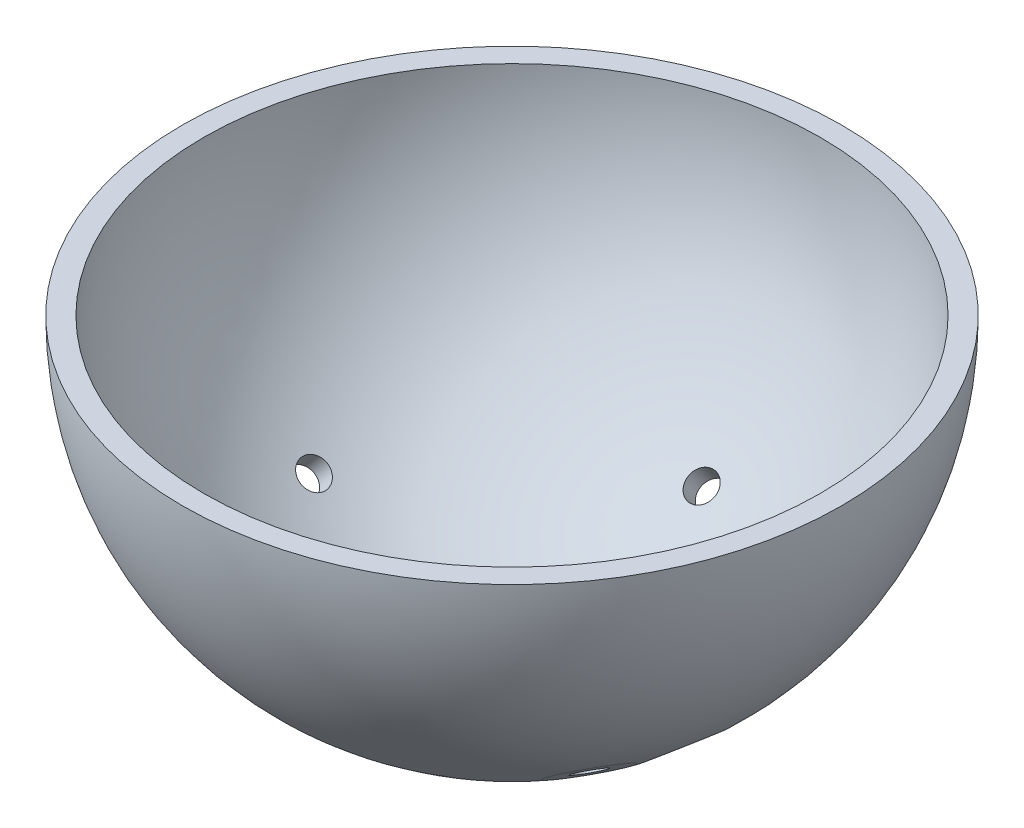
ISO-10303-21;
HEADER;
FILE_DESCRIPTION(('STEP AP214'),'2;1');
FILE_NAME('part.step','',(''),(''),'','','');
FILE_SCHEMA(('AUTOMOTIVE_DESIGN { 1 0 10303 214 1 1 1 1 }'));
ENDSEC;
DATA;
#1=APPLICATION_CONTEXT('core data for automotive mechanical design processes');
#2=APPLICATION_PROTOCOL_DEFINITION('international standard','automotive_design',2000,#1);
#3=PRODUCT_CONTEXT('',#1,'mechanical');
#4=PRODUCT('Part','Part','',(#3));
#5=PRODUCT_RELATED_PRODUCT_CATEGORY('part','',(#4));
#6=PRODUCT_DEFINITION_FORMATION('','',#4);
#7=PRODUCT_DEFINITION_CONTEXT('part definition',#1,'design');
#8=PRODUCT_DEFINITION('design','',#6,#7);
#9=PRODUCT_DEFINITION_SHAPE('','',#8);
#10=(LENGTH_UNIT() NAMED_UNIT(*) SI_UNIT(.MILLI.,.METRE.));
#11=(NAMED_UNIT(*) PLANE_ANGLE_UNIT() SI_UNIT($,.RADIAN.));
#12=(NAMED_UNIT(*) SI_UNIT($,.STERADIAN.) SOLID_ANGLE_UNIT());
#13=UNCERTAINTY_MEASURE_WITH_UNIT(LENGTH_MEASURE(1.E-05),#10,'distance_accuracy_value','');
#14=(GEOMETRIC_REPRESENTATION_CONTEXT(3) GLOBAL_UNCERTAINTY_ASSIGNED_CONTEXT((#13)) GLOBAL_UNIT_ASSIGNED_CONTEXT((#10,
#11,#12)) REPRESENTATION_CONTEXT('',''));
#15=CARTESIAN_POINT('',(0.,0.,0.));
#16=DIRECTION('',(0.,0.,1.));
#17=DIRECTION('',(1.,0.,0.));
#18=AXIS2_PLACEMENT_3D('',#15,#16,#17);
#19=CARTESIAN_POINT('',(0.,0.,0.));
#20=DIRECTION('',(0.,1.,0.));
#21=DIRECTION('',(-1.,0.,0.));
#22=AXIS2_PLACEMENT_3D('',#19,#20,#21);
#23=SPHERICAL_SURFACE('',#22,215.9);
#24=CARTESIAN_POINT('',(135.935089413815,-164.500259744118,23.9690238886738));
#25=DIRECTION('',(-0.63302222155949,0.766044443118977,-0.111618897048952));
#26=DIRECTION('',(-0.619701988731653,-0.587858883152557,-0.519991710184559));
#27=AXIS2_PLACEMENT_3D('',#24,#25,#26);
#28=CIRCLE('',#27,22.352);
#29=CARTESIAN_POINT('',(122.083510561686,-177.640081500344,12.3461691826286));
#30=VERTEX_POINT('',#29);
#31=EDGE_CURVE('E76',#30,#30,#28,.T.);
#32=ORIENTED_EDGE('',*,*,#31,.T.);
#33=EDGE_LOOP('',(#32));
#34=FACE_BOUND('',#33,.T.);
#35=CARTESIAN_POINT('',(119.539311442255,-164.500259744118,-69.016053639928));
#36=DIRECTION('',(-0.556670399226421,0.766044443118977,0.321393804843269));
#37=DIRECTION('',(-0.808963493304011,-0.587858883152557,0.));
#38=AXIS2_PLACEMENT_3D('',#35,#36,#37);
#39=CIRCLE('',#38,22.352);
#40=CARTESIAN_POINT('',(101.457359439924,-177.640081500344,-69.016053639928));
#41=VERTEX_POINT('',#40);
#42=EDGE_CURVE('E68',#41,#41,#39,.T.);
#43=ORIENTED_EDGE('',*,*,#42,.T.);
#44=EDGE_LOOP('',(#43));
#45=FACE_BOUND('',#44,.T.);
#46=CARTESIAN_POINT('',(-138.032107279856,-164.500259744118,0.));
#47=DIRECTION('',(0.642787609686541,0.766044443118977,0.));
#48=DIRECTION('',(-0.766044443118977,0.642787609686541,0.));
#49=AXIS2_PLACEMENT_3D('',#46,#47,#48);
#50=CIRCLE('',#49,22.352);
#51=CARTESIAN_POINT('',(-155.154732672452,-150.132671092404,0.));
#52=VERTEX_POINT('',#51);
#53=EDGE_CURVE('E67',#52,#52,#50,.T.);
#54=ORIENTED_EDGE('',*,*,#53,.T.);
#55=EDGE_LOOP('',(#54));
#56=FACE_BOUND('',#55,.T.);
#57=CARTESIAN_POINT('',(0.,-169.217301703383,132.207045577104));
#58=DIRECTION('',(0.,0.788010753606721,-0.615661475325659));
#59=DIRECTION('',(0.,0.615661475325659,0.788010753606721));
#60=AXIS2_PLACEMENT_3D('',#57,#58,#59);
#61=CIRCLE('',#60,22.352);
#62=CARTESIAN_POINT('',(0.,-155.456036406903,149.820661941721));
#63=VERTEX_POINT('',#62);
#64=EDGE_CURVE('E62',#63,#63,#61,.T.);
#65=ORIENTED_EDGE('',*,*,#64,.T.);
#66=EDGE_LOOP('',(#65));
#67=FACE_BOUND('',#66,.T.);
#68=CARTESIAN_POINT('',(0.,0.,0.));
#69=DIRECTION('',(0.,1.,0.));
#70=DIRECTION('',(0.,0.,1.));
#71=AXIS2_PLACEMENT_3D('',#68,#69,#70);
#72=CIRCLE('',#71,215.9);
#73=CARTESIAN_POINT('',(0.,0.,215.9));
#74=VERTEX_POINT('',#73);
#75=EDGE_CURVE('E42',#74,#74,#72,.T.);
#76=ORIENTED_EDGE('',*,*,#75,.F.);
#77=EDGE_LOOP('',(#76));
#78=FACE_BOUND('',#77,.T.);
#79=CARTESIAN_POINT('',(0.,-169.217301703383,-132.207045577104));
#80=DIRECTION('',(0.,0.788010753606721,0.61566147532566));
#81=DIRECTION('',(0.,-0.61566147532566,0.788010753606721));
#82=AXIS2_PLACEMENT_3D('',#79,#80,#81);
#83=CIRCLE('',#82,22.352);
#84=CARTESIAN_POINT('',(0.,-182.978566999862,-114.593429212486));
#85=VERTEX_POINT('',#84);
#86=EDGE_CURVE('E57',#85,#85,#83,.T.);
#87=ORIENTED_EDGE('',*,*,#86,.T.);
#88=EDGE_LOOP('',(#87));
#89=FACE_BOUND('',#88,.T.);
#90=CARTESIAN_POINT('',(135.935089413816,-164.500259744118,-23.9690238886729));
#91=DIRECTION('',(-0.633022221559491,0.766044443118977,0.111618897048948));
#92=DIRECTION('',(-0.760177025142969,-0.587858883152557,-0.276681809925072));
#93=AXIS2_PLACEMENT_3D('',#90,#91,#92);
#94=CIRCLE('',#93,22.352);
#95=CARTESIAN_POINT('',(118.94361254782,-177.640081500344,-30.1534157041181));
#96=VERTEX_POINT('',#95);
#97=EDGE_CURVE('E72',#96,#96,#94,.T.);
#98=ORIENTED_EDGE('',*,*,#97,.T.);
#99=EDGE_LOOP('',(#98));
#100=FACE_BOUND('',#99,.T.);
#101=CARTESIAN_POINT('',(119.539311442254,-164.500259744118,69.0160536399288));
#102=DIRECTION('',(-0.556670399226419,0.766044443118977,-0.321393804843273));
#103=DIRECTION('',(-0.404481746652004,-0.587858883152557,-0.700582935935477));
#104=AXIS2_PLACEMENT_3D('',#101,#102,#103);
#105=CIRCLE('',#104,22.352);
#106=CARTESIAN_POINT('',(110.498335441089,-177.640081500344,53.356623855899));
#107=VERTEX_POINT('',#106);
#108=EDGE_CURVE('E145',#107,#107,#105,.T.);
#109=ORIENTED_EDGE('',*,*,#108,.T.);
#110=EDGE_LOOP('',(#109));
#111=FACE_BOUND('',#110,.T.);
#112=ADVANCED_FACE('F35',(#34,#45,#56,#67,#78,#89,#100,#111),#23,.T.);
#113=CARTESIAN_POINT('',(0.,0.,0.));
#114=DIRECTION('',(0.,1.,0.));
#115=DIRECTION('',(-1.,0.,0.));
#116=AXIS2_PLACEMENT_3D('',#113,#114,#115);
#117=SPHERICAL_SURFACE('',#116,201.93);
#118=CARTESIAN_POINT('',(127.683891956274,-154.515169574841,22.5141151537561));
#119=DIRECTION('',(-0.63302222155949,0.766044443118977,-0.111618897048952));
#120=DIRECTION('',(-0.770861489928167,-0.637002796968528,0.));
#121=AXIS2_PLACEMENT_3D('',#118,#119,#120);
#122=CIRCLE('',#121,9.52500000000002);
#123=CARTESIAN_POINT('',(120.341436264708,-160.582621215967,22.5141151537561));
#124=VERTEX_POINT('',#123);
#125=EDGE_CURVE('E73',#124,#124,#122,.F.);
#126=ORIENTED_EDGE('',*,*,#125,.T.);
#127=EDGE_LOOP('',(#126));
#128=FACE_BOUND('',#127,.T.);
#129=CARTESIAN_POINT('',(112.283330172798,-154.515169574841,-64.8268109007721));
#130=DIRECTION('',(-0.556670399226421,0.766044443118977,0.321393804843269));
#131=DIRECTION('',(-0.808963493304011,-0.587858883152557,0.));
#132=AXIS2_PLACEMENT_3D('',#129,#130,#131);
#133=CIRCLE('',#132,9.52500000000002);
#134=CARTESIAN_POINT('',(104.577952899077,-160.114525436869,-64.8268109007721));
#135=VERTEX_POINT('',#134);
#136=EDGE_CURVE('E64',#135,#135,#133,.F.);
#137=ORIENTED_EDGE('',*,*,#136,.T.);
#138=EDGE_LOOP('',(#137));
#139=FACE_BOUND('',#138,.T.);
#140=CARTESIAN_POINT('',(-129.652462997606,-154.513788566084,0.));
#141=DIRECTION('',(0.642787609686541,0.766044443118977,0.));
#142=DIRECTION('',(-0.766044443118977,0.642787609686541,0.));
#143=AXIS2_PLACEMENT_3D('',#140,#141,#142);
#144=CIRCLE('',#143,9.56309999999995);
#145=CARTESIAN_POINT('',(-136.978222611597,-148.366746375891,0.));
#146=VERTEX_POINT('',#145);
#147=EDGE_CURVE('E59',#146,#146,#144,.T.);
#148=ORIENTED_EDGE('',*,*,#147,.F.);
#149=EDGE_LOOP('',(#148));
#150=FACE_BOUND('',#149,.T.);
#151=CARTESIAN_POINT('',(0.,-158.944468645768,124.181028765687));
#152=DIRECTION('',(0.,0.788010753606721,-0.615661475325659));
#153=DIRECTION('',(0.,0.615661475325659,0.788010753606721));
#154=AXIS2_PLACEMENT_3D('',#151,#152,#153);
#155=CIRCLE('',#154,9.56309999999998);
#156=CARTESIAN_POINT('',(0.,-153.056836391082,131.716854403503));
#157=VERTEX_POINT('',#156);
#158=EDGE_CURVE('E54',#157,#157,#155,.T.);
#159=ORIENTED_EDGE('',*,*,#158,.F.);
#160=EDGE_LOOP('',(#159));
#161=FACE_BOUND('',#160,.T.);
#162=CARTESIAN_POINT('',(0.,0.,0.));
#163=DIRECTION('',(0.,1.,0.));
#164=DIRECTION('',(0.,0.,1.));
#165=AXIS2_PLACEMENT_3D('',#162,#163,#164);
#166=CIRCLE('',#165,201.93);
#167=CARTESIAN_POINT('',(0.,0.,201.93));
#168=VERTEX_POINT('',#167);
#169=EDGE_CURVE('E10',#168,#168,#166,.T.);
#170=ORIENTED_EDGE('',*,*,#169,.T.);
#171=EDGE_LOOP('',(#170));
#172=FACE_BOUND('',#171,.T.);
#173=CARTESIAN_POINT('',(0.,-158.944468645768,-124.181028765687));
#174=DIRECTION('',(0.,0.788010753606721,0.61566147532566));
#175=DIRECTION('',(0.,-0.61566147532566,0.788010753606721));
#176=AXIS2_PLACEMENT_3D('',#173,#174,#175);
#177=CIRCLE('',#176,9.5631);
#178=CARTESIAN_POINT('',(0.,-164.832100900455,-116.64520312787));
#179=VERTEX_POINT('',#178);
#180=EDGE_CURVE('E47',#179,#179,#177,.F.);
#181=ORIENTED_EDGE('',*,*,#180,.T.);
#182=EDGE_LOOP('',(#181));
#183=FACE_BOUND('',#182,.T.);
#184=CARTESIAN_POINT('',(127.683891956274,-154.515169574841,-22.5141151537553));
#185=DIRECTION('',(-0.633022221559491,0.766044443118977,0.111618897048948));
#186=DIRECTION('',(-0.770861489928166,-0.637002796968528,0.));
#187=AXIS2_PLACEMENT_3D('',#184,#185,#186);
#188=CIRCLE('',#187,9.52500000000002);
#189=CARTESIAN_POINT('',(120.341436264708,-160.582621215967,-22.5141151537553));
#190=VERTEX_POINT('',#189);
#191=EDGE_CURVE('E69',#190,#190,#188,.F.);
#192=ORIENTED_EDGE('',*,*,#191,.T.);
#193=EDGE_LOOP('',(#192));
#194=FACE_BOUND('',#193,.T.);
#195=CARTESIAN_POINT('',(112.283330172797,-154.515169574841,64.8268109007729));
#196=DIRECTION('',(-0.556670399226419,0.766044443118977,-0.321393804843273));
#197=DIRECTION('',(-0.808963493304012,-0.587858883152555,0.));
#198=AXIS2_PLACEMENT_3D('',#195,#196,#197);
#199=CIRCLE('',#198,9.52500000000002);
#200=CARTESIAN_POINT('',(104.577952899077,-160.114525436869,64.8268109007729));
#201=VERTEX_POINT('',#200);
#202=EDGE_CURVE('E38',#201,#201,#199,.F.);
#203=ORIENTED_EDGE('',*,*,#202,.T.);
#204=EDGE_LOOP('',(#203));
#205=FACE_BOUND('',#204,.T.);
#206=ADVANCED_FACE('F122',(#128,#139,#150,#161,#172,#183,#194,#205),#117,.F.);
#207=CARTESIAN_POINT('',(-215.9,0.,0.));
#208=DIRECTION('',(0.,1.,0.));
#209=DIRECTION('',(0.,0.,1.));
#210=AXIS2_PLACEMENT_3D('',#207,#208,#209);
#211=PLANE('',#210);
#212=ORIENTED_EDGE('',*,*,#75,.T.);
#213=EDGE_LOOP('',(#212));
#214=FACE_BOUND('',#213,.T.);
#215=ORIENTED_EDGE('',*,*,#169,.F.);
#216=EDGE_LOOP('',(#215));
#217=FACE_BOUND('',#216,.T.);
#218=ADVANCED_FACE('F113',(#214,#217),#211,.T.);
#219=CARTESIAN_POINT('',(0.,0.,0.));
#220=DIRECTION('',(0.,0.788010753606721,0.61566147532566));
#221=DIRECTION('',(0.,-0.61566147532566,0.788010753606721));
#222=AXIS2_PLACEMENT_3D('',#219,#220,#221);
#223=CYLINDRICAL_SURFACE('',#222,9.5631);
#224=ORIENTED_EDGE('',*,*,#180,.F.);
#225=EDGE_LOOP('',(#224));
#226=FACE_BOUND('',#225,.T.);
#227=CARTESIAN_POINT('',(0.,-169.217301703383,-132.207045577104));
#228=DIRECTION('',(0.,0.788010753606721,0.61566147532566));
#229=DIRECTION('',(0.,-0.61566147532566,0.788010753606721));
#230=AXIS2_PLACEMENT_3D('',#227,#228,#229);
#231=CIRCLE('',#230,9.56310000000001);
#232=CARTESIAN_POINT('',(0.,-175.104933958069,-124.671219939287));
#233=VERTEX_POINT('',#232);
#234=EDGE_CURVE('E53',#233,#233,#231,.T.);
#235=ORIENTED_EDGE('',*,*,#234,.F.);
#236=EDGE_LOOP('',(#235));
#237=FACE_BOUND('',#236,.T.);
#238=ADVANCED_FACE('F111',(#226,#237),#223,.F.);
#239=CARTESIAN_POINT('',(0.,-163.329669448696,-139.74287121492));
#240=DIRECTION('',(0.,-0.788010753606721,-0.61566147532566));
#241=DIRECTION('',(0.,0.61566147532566,-0.788010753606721));
#242=AXIS2_PLACEMENT_3D('',#239,#240,#241);
#243=PLANE('',#242);
#244=ORIENTED_EDGE('',*,*,#234,.T.);
#245=EDGE_LOOP('',(#244));
#246=FACE_BOUND('',#245,.T.);
#247=ORIENTED_EDGE('',*,*,#86,.F.);
#248=EDGE_LOOP('',(#247));
#249=FACE_BOUND('',#248,.T.);
#250=ADVANCED_FACE('F108',(#246,#249),#243,.T.);
#251=CARTESIAN_POINT('',(0.,0.,0.));
#252=DIRECTION('',(0.,0.788010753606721,-0.615661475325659));
#253=DIRECTION('',(0.,0.615661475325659,0.788010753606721));
#254=AXIS2_PLACEMENT_3D('',#251,#252,#253);
#255=CYLINDRICAL_SURFACE('',#254,9.56309999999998);
#256=ORIENTED_EDGE('',*,*,#158,.T.);
#257=EDGE_LOOP('',(#256));
#258=FACE_BOUND('',#257,.T.);
#259=CARTESIAN_POINT('',(0.,-169.217301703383,132.207045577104));
#260=DIRECTION('',(0.,0.788010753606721,-0.615661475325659));
#261=DIRECTION('',(0.,0.615661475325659,0.788010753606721));
#262=AXIS2_PLACEMENT_3D('',#259,#260,#261);
#263=CIRCLE('',#262,9.56310000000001);
#264=CARTESIAN_POINT('',(0.,-163.329669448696,139.74287121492));
#265=VERTEX_POINT('',#264);
#266=EDGE_CURVE('E58',#265,#265,#263,.T.);
#267=ORIENTED_EDGE('',*,*,#266,.F.);
#268=EDGE_LOOP('',(#267));
#269=FACE_BOUND('',#268,.T.);
#270=ADVANCED_FACE('F120',(#258,#269),#255,.F.);
#271=CARTESIAN_POINT('',(0.,-163.329669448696,139.74287121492));
#272=DIRECTION('',(0.,0.788010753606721,-0.615661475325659));
#273=DIRECTION('',(0.,0.615661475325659,0.788010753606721));
#274=AXIS2_PLACEMENT_3D('',#271,#272,#273);
#275=PLANE('',#274);
#276=ORIENTED_EDGE('',*,*,#64,.F.);
#277=EDGE_LOOP('',(#276));
#278=FACE_BOUND('',#277,.T.);
#279=ORIENTED_EDGE('',*,*,#266,.T.);
#280=EDGE_LOOP('',(#279));
#281=FACE_BOUND('',#280,.T.);
#282=ADVANCED_FACE('F196',(#278,#281),#275,.F.);
#283=CARTESIAN_POINT('',(0.,0.,0.));
#284=DIRECTION('',(0.642787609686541,0.766044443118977,0.));
#285=DIRECTION('',(-0.766044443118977,0.642787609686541,0.));
#286=AXIS2_PLACEMENT_3D('',#283,#284,#285);
#287=CYLINDRICAL_SURFACE('',#286,9.56309999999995);
#288=ORIENTED_EDGE('',*,*,#147,.T.);
#289=EDGE_LOOP('',(#288));
#290=FACE_BOUND('',#289,.T.);
#291=CARTESIAN_POINT('',(-138.032107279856,-164.500259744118,0.));
#292=DIRECTION('',(0.642787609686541,0.766044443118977,0.));
#293=DIRECTION('',(-0.766044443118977,0.642787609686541,0.));
#294=AXIS2_PLACEMENT_3D('',#291,#292,#293);
#295=CIRCLE('',#294,9.56309999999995);
#296=CARTESIAN_POINT('',(-145.357866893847,-158.353217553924,0.));
#297=VERTEX_POINT('',#296);
#298=EDGE_CURVE('E63',#297,#297,#295,.T.);
#299=ORIENTED_EDGE('',*,*,#298,.F.);
#300=EDGE_LOOP('',(#299));
#301=FACE_BOUND('',#300,.T.);
#302=ADVANCED_FACE('F192',(#290,#301),#287,.F.);
#303=CARTESIAN_POINT('',(-145.357866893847,-158.353217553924,0.));
#304=DIRECTION('',(0.642787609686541,0.766044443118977,0.));
#305=DIRECTION('',(-0.766044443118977,0.642787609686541,0.));
#306=AXIS2_PLACEMENT_3D('',#303,#304,#305);
#307=PLANE('',#306);
#308=ORIENTED_EDGE('',*,*,#53,.F.);
#309=EDGE_LOOP('',(#308));
#310=FACE_BOUND('',#309,.T.);
#311=ORIENTED_EDGE('',*,*,#298,.T.);
#312=EDGE_LOOP('',(#311));
#313=FACE_BOUND('',#312,.T.);
#314=ADVANCED_FACE('F188',(#310,#313),#307,.F.);
#315=CARTESIAN_POINT('',(125.858329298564,-158.377707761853,-72.6643403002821));
#316=DIRECTION('',(0.556670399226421,-0.766044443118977,-0.321393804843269));
#317=DIRECTION('',(0.808963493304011,0.587858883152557,0.));
#318=AXIS2_PLACEMENT_3D('',#315,#316,#317);
#319=PLANE('',#318);
#320=CARTESIAN_POINT('',(119.539311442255,-164.500259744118,-69.016053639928));
#321=DIRECTION('',(-0.556670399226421,0.766044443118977,0.321393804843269));
#322=DIRECTION('',(-0.808963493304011,-0.587858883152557,0.));
#323=AXIS2_PLACEMENT_3D('',#320,#321,#322);
#324=CIRCLE('',#323,9.52500000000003);
#325=CARTESIAN_POINT('',(111.833934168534,-170.099615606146,-69.016053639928));
#326=VERTEX_POINT('',#325);
#327=EDGE_CURVE('E71',#326,#326,#324,.T.);
#328=ORIENTED_EDGE('',*,*,#327,.T.);
#329=EDGE_LOOP('',(#328));
#330=FACE_BOUND('',#329,.T.);
#331=ORIENTED_EDGE('',*,*,#42,.F.);
#332=EDGE_LOOP('',(#331));
#333=FACE_BOUND('',#332,.T.);
#334=ADVANCED_FACE('F184',(#330,#333),#319,.T.);
#335=CARTESIAN_POINT('',(0.,0.,0.));
#336=DIRECTION('',(-0.556670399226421,0.766044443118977,0.321393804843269));
#337=DIRECTION('',(-0.808963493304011,-0.587858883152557,0.));
#338=AXIS2_PLACEMENT_3D('',#335,#336,#337);
#339=CYLINDRICAL_SURFACE('',#338,9.52500000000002);
#340=ORIENTED_EDGE('',*,*,#136,.F.);
#341=EDGE_LOOP('',(#340));
#342=FACE_BOUND('',#341,.T.);
#343=ORIENTED_EDGE('',*,*,#327,.F.);
#344=EDGE_LOOP('',(#343));
#345=FACE_BOUND('',#344,.T.);
#346=ADVANCED_FACE('F180',(#342,#345),#339,.F.);
#347=CARTESIAN_POINT('',(143.120811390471,-158.377707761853,-25.236060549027));
#348=DIRECTION('',(0.633022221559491,-0.766044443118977,-0.111618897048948));
#349=DIRECTION('',(0.760177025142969,0.587858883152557,0.276681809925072));
#350=AXIS2_PLACEMENT_3D('',#347,#348,#349);
#351=PLANE('',#350);
#352=CARTESIAN_POINT('',(135.935089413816,-164.500259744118,-23.9690238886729));
#353=DIRECTION('',(-0.633022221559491,0.766044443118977,0.111618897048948));
#354=DIRECTION('',(-0.760177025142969,-0.587858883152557,-0.276681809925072));
#355=AXIS2_PLACEMENT_3D('',#352,#353,#354);
#356=CIRCLE('',#355,9.52500000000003);
#357=CARTESIAN_POINT('',(128.694403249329,-170.099615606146,-26.6044181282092));
#358=VERTEX_POINT('',#357);
#359=EDGE_CURVE('E75',#358,#358,#356,.T.);
#360=ORIENTED_EDGE('',*,*,#359,.T.);
#361=EDGE_LOOP('',(#360));
#362=FACE_BOUND('',#361,.T.);
#363=ORIENTED_EDGE('',*,*,#97,.F.);
#364=EDGE_LOOP('',(#363));
#365=FACE_BOUND('',#364,.T.);
#366=ADVANCED_FACE('F176',(#362,#365),#351,.T.);
#367=CARTESIAN_POINT('',(0.,0.,0.));
#368=DIRECTION('',(-0.633022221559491,0.766044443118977,0.111618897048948));
#369=DIRECTION('',(-0.760177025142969,-0.587858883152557,-0.276681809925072));
#370=AXIS2_PLACEMENT_3D('',#367,#368,#369);
#371=CYLINDRICAL_SURFACE('',#370,9.52500000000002);
#372=ORIENTED_EDGE('',*,*,#191,.F.);
#373=EDGE_LOOP('',(#372));
#374=FACE_BOUND('',#373,.T.);
#375=ORIENTED_EDGE('',*,*,#359,.F.);
#376=EDGE_LOOP('',(#375));
#377=FACE_BOUND('',#376,.T.);
#378=ADVANCED_FACE('F172',(#374,#377),#371,.F.);
#379=CARTESIAN_POINT('',(143.120811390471,-158.377707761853,25.236060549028));
#380=DIRECTION('',(0.63302222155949,-0.766044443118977,0.111618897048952));
#381=DIRECTION('',(0.619701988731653,0.587858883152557,0.519991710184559));
#382=AXIS2_PLACEMENT_3D('',#379,#380,#381);
#383=PLANE('',#382);
#384=CARTESIAN_POINT('',(135.935089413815,-164.500259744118,23.9690238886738));
#385=DIRECTION('',(-0.63302222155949,0.766044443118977,-0.111618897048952));
#386=DIRECTION('',(-0.619701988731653,-0.587858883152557,-0.519991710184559));
#387=AXIS2_PLACEMENT_3D('',#384,#385,#386);
#388=CIRCLE('',#387,9.52500000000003);
#389=CARTESIAN_POINT('',(130.032427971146,-170.099615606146,19.0161028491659));
#390=VERTEX_POINT('',#389);
#391=EDGE_CURVE('E82',#390,#390,#388,.T.);
#392=ORIENTED_EDGE('',*,*,#391,.T.);
#393=EDGE_LOOP('',(#392));
#394=FACE_BOUND('',#393,.T.);
#395=ORIENTED_EDGE('',*,*,#31,.F.);
#396=EDGE_LOOP('',(#395));
#397=FACE_BOUND('',#396,.T.);
#398=ADVANCED_FACE('F168',(#394,#397),#383,.T.);
#399=CARTESIAN_POINT('',(0.,0.,0.));
#400=DIRECTION('',(-0.63302222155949,0.766044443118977,-0.111618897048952));
#401=DIRECTION('',(-0.619701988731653,-0.587858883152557,-0.519991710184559));
#402=AXIS2_PLACEMENT_3D('',#399,#400,#401);
#403=CYLINDRICAL_SURFACE('',#402,9.52500000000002);
#404=ORIENTED_EDGE('',*,*,#125,.F.);
#405=EDGE_LOOP('',(#404));
#406=FACE_BOUND('',#405,.T.);
#407=ORIENTED_EDGE('',*,*,#391,.F.);
#408=EDGE_LOOP('',(#407));
#409=FACE_BOUND('',#408,.T.);
#410=ADVANCED_FACE('F162',(#406,#409),#403,.F.);
#411=CARTESIAN_POINT('',(125.858329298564,-158.377707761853,72.664340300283));
#412=DIRECTION('',(0.556670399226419,-0.766044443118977,0.321393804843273));
#413=DIRECTION('',(0.404481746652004,0.587858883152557,0.700582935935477));
#414=AXIS2_PLACEMENT_3D('',#411,#412,#413);
#415=PLANE('',#414);
#416=CARTESIAN_POINT('',(119.539311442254,-164.500259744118,69.0160536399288));
#417=DIRECTION('',(-0.556670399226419,0.766044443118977,-0.321393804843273));
#418=DIRECTION('',(-0.404481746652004,-0.587858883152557,-0.700582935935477));
#419=AXIS2_PLACEMENT_3D('',#416,#417,#418);
#420=CIRCLE('',#419,9.52500000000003);
#421=CARTESIAN_POINT('',(115.686622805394,-170.099615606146,62.3430011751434));
#422=VERTEX_POINT('',#421);
#423=EDGE_CURVE('E147',#422,#422,#420,.T.);
#424=ORIENTED_EDGE('',*,*,#423,.T.);
#425=EDGE_LOOP('',(#424));
#426=FACE_BOUND('',#425,.T.);
#427=ORIENTED_EDGE('',*,*,#108,.F.);
#428=EDGE_LOOP('',(#427));
#429=FACE_BOUND('',#428,.T.);
#430=ADVANCED_FACE('F153',(#426,#429),#415,.T.);
#431=CARTESIAN_POINT('',(0.,0.,0.));
#432=DIRECTION('',(-0.556670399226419,0.766044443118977,-0.321393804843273));
#433=DIRECTION('',(-0.404481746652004,-0.587858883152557,-0.700582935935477));
#434=AXIS2_PLACEMENT_3D('',#431,#432,#433);
#435=CYLINDRICAL_SURFACE('',#434,9.52500000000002);
#436=ORIENTED_EDGE('',*,*,#202,.F.);
#437=EDGE_LOOP('',(#436));
#438=FACE_BOUND('',#437,.T.);
#439=ORIENTED_EDGE('',*,*,#423,.F.);
#440=EDGE_LOOP('',(#439));
#441=FACE_BOUND('',#440,.T.);
#442=ADVANCED_FACE('F155',(#438,#441),#435,.F.);
#443=CLOSED_SHELL('',(#112,#206,#218,#238,#250,#270,#282,#302,#314,#334,#346,#366,#378,#398,
#410,#430,#442));
#444=MANIFOLD_SOLID_BREP('B2',#443);
#445=ADVANCED_BREP_SHAPE_REPRESENTATION('',(#18,#444),#14);
#446=SHAPE_DEFINITION_REPRESENTATION(#9,#445);
ENDSEC;
END-ISO-10303-21;
